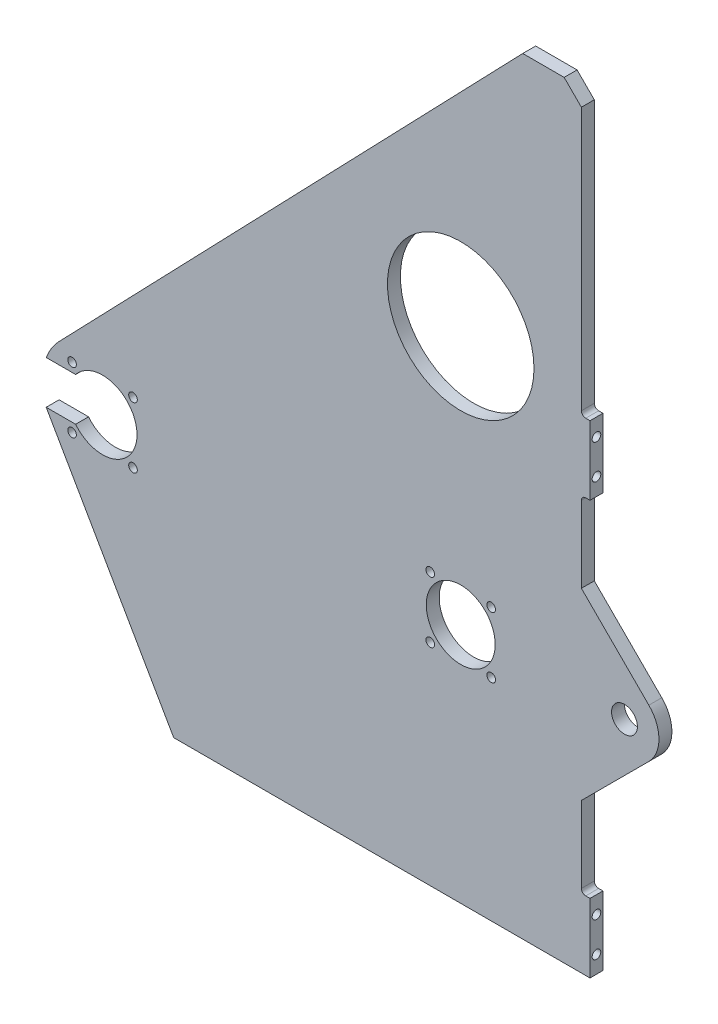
ISO-10303-21;
HEADER;
FILE_DESCRIPTION(('STEP AP214'),'2;1');
FILE_NAME('part.step','',(''),(''),'','','');
FILE_SCHEMA(('AUTOMOTIVE_DESIGN { 1 0 10303 214 1 1 1 1 }'));
ENDSEC;
DATA;
#1=APPLICATION_CONTEXT('core data for automotive mechanical design processes');
#2=APPLICATION_PROTOCOL_DEFINITION('international standard','automotive_design',2000,#1);
#3=PRODUCT_CONTEXT('',#1,'mechanical');
#4=PRODUCT('Part','Part','',(#3));
#5=PRODUCT_RELATED_PRODUCT_CATEGORY('part','',(#4));
#6=PRODUCT_DEFINITION_FORMATION('','',#4);
#7=PRODUCT_DEFINITION_CONTEXT('part definition',#1,'design');
#8=PRODUCT_DEFINITION('design','',#6,#7);
#9=PRODUCT_DEFINITION_SHAPE('','',#8);
#10=(LENGTH_UNIT() NAMED_UNIT(*) SI_UNIT(.MILLI.,.METRE.));
#11=(NAMED_UNIT(*) PLANE_ANGLE_UNIT() SI_UNIT($,.RADIAN.));
#12=(NAMED_UNIT(*) SI_UNIT($,.STERADIAN.) SOLID_ANGLE_UNIT());
#13=UNCERTAINTY_MEASURE_WITH_UNIT(LENGTH_MEASURE(1.E-05),#10,'distance_accuracy_value','');
#14=(GEOMETRIC_REPRESENTATION_CONTEXT(3) GLOBAL_UNCERTAINTY_ASSIGNED_CONTEXT((#13)) GLOBAL_UNIT_ASSIGNED_CONTEXT((#10,
#11,#12)) REPRESENTATION_CONTEXT('',''));
#15=CARTESIAN_POINT('',(0.,0.,0.));
#16=DIRECTION('',(0.,0.,1.));
#17=DIRECTION('',(1.,0.,0.));
#18=AXIS2_PLACEMENT_3D('',#15,#16,#17);
#19=CARTESIAN_POINT('',(145.,-195.,0.));
#20=DIRECTION('',(0.,0.,-1.));
#21=DIRECTION('',(-1.,0.,0.));
#22=AXIS2_PLACEMENT_3D('',#19,#20,#21);
#23=PLANE('',#22);
#24=CARTESIAN_POINT('',(-380.264660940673,38.3653390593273,0.));
#25=DIRECTION('',(0.,0.,-1.));
#26=DIRECTION('',(-1.,0.,0.));
#27=AXIS2_PLACEMENT_3D('',#24,#25,#26);
#28=CIRCLE('',#27,5.);
#29=CARTESIAN_POINT('',(-385.264660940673,38.3653390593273,0.));
#30=VERTEX_POINT('',#29);
#31=EDGE_CURVE('E251',#30,#30,#28,.T.);
#32=ORIENTED_EDGE('',*,*,#31,.F.);
#33=EDGE_LOOP('',(#32));
#34=FACE_BOUND('',#33,.T.);
#35=CARTESIAN_POINT('',(-450.975339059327,-32.3453390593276,0.));
#36=DIRECTION('',(0.,0.,-1.));
#37=DIRECTION('',(-1.,0.,0.));
#38=AXIS2_PLACEMENT_3D('',#35,#36,#37);
#39=CIRCLE('',#38,5.);
#40=CARTESIAN_POINT('',(-455.975339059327,-32.3453390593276,0.));
#41=VERTEX_POINT('',#40);
#42=EDGE_CURVE('E263',#41,#41,#39,.T.);
#43=ORIENTED_EDGE('',*,*,#42,.F.);
#44=EDGE_LOOP('',(#43));
#45=FACE_BOUND('',#44,.T.);
#46=CARTESIAN_POINT('',(-35.3553390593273,35.3553390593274,0.));
#47=DIRECTION('',(0.,0.,-1.));
#48=DIRECTION('',(-1.,0.,0.));
#49=AXIS2_PLACEMENT_3D('',#46,#47,#48);
#50=CIRCLE('',#49,5.);
#51=CARTESIAN_POINT('',(-40.3553390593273,35.3553390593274,0.));
#52=VERTEX_POINT('',#51);
#53=EDGE_CURVE('E275',#52,#52,#50,.T.);
#54=ORIENTED_EDGE('',*,*,#53,.F.);
#55=EDGE_LOOP('',(#54));
#56=FACE_BOUND('',#55,.T.);
#57=CARTESIAN_POINT('',(35.3553390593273,-35.3553390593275,0.));
#58=DIRECTION('',(0.,0.,-1.));
#59=DIRECTION('',(-1.,0.,0.));
#60=AXIS2_PLACEMENT_3D('',#57,#58,#59);
#61=CIRCLE('',#60,5.);
#62=CARTESIAN_POINT('',(30.3553390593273,-35.3553390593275,0.));
#63=VERTEX_POINT('',#62);
#64=EDGE_CURVE('E287',#63,#63,#61,.T.);
#65=ORIENTED_EDGE('',*,*,#64,.F.);
#66=EDGE_LOOP('',(#65));
#67=FACE_BOUND('',#66,.T.);
#68=CARTESIAN_POINT('',(190.,0.,0.));
#69=DIRECTION('',(0.,0.,1.));
#70=DIRECTION('',(1.,0.,0.));
#71=AXIS2_PLACEMENT_3D('',#68,#69,#70);
#72=CIRCLE('',#71,15.);
#73=CARTESIAN_POINT('',(205.,0.,0.));
#74=VERTEX_POINT('',#73);
#75=EDGE_CURVE('E299',#74,#74,#72,.T.);
#76=ORIENTED_EDGE('',*,*,#75,.T.);
#77=EDGE_LOOP('',(#76));
#78=FACE_BOUND('',#77,.T.);
#79=DIRECTION('',(-1.,0.,0.));
#80=VECTOR('',#79,1.);
#81=CARTESIAN_POINT('',(140.,610.,0.));
#82=LINE('',#81,#80);
#83=CARTESIAN_POINT('',(120.,610.,0.));
#84=VERTEX_POINT('',#83);
#85=CARTESIAN_POINT('',(71.9500000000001,610.,0.));
#86=VERTEX_POINT('',#85);
#87=EDGE_CURVE('E344',#84,#86,#82,.T.);
#88=ORIENTED_EDGE('',*,*,#87,.F.);
#89=DIRECTION('',(-0.707106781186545,0.70710678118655,0.));
#90=VECTOR('',#89,1.);
#91=CARTESIAN_POINT('',(535.,194.999999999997,0.));
#92=LINE('',#91,#90);
#93=CARTESIAN_POINT('',(140.,590.,0.));
#94=VERTEX_POINT('',#93);
#95=EDGE_CURVE('E49',#84,#94,#92,.F.);
#96=ORIENTED_EDGE('',*,*,#95,.T.);
#97=DIRECTION('',(0.,1.,0.));
#98=VECTOR('',#97,1.);
#99=CARTESIAN_POINT('',(140.,284.999999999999,0.));
#100=LINE('',#99,#98);
#101=CARTESIAN_POINT('',(140.,284.999999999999,0.));
#102=VERTEX_POINT('',#101);
#103=EDGE_CURVE('E342',#102,#94,#100,.T.);
#104=ORIENTED_EDGE('',*,*,#103,.F.);
#105=CARTESIAN_POINT('',(145.,284.999999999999,0.));
#106=DIRECTION('',(0.,0.,-1.));
#107=DIRECTION('',(-1.,0.,0.));
#108=AXIS2_PLACEMENT_3D('',#105,#106,#107);
#109=CIRCLE('',#108,5.);
#110=CARTESIAN_POINT('',(145.,279.999999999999,0.));
#111=VERTEX_POINT('',#110);
#112=EDGE_CURVE('E340',#111,#102,#109,.T.);
#113=ORIENTED_EDGE('',*,*,#112,.F.);
#114=DIRECTION('',(-1.,0.,0.));
#115=VECTOR('',#114,1.);
#116=CARTESIAN_POINT('',(145.,279.999999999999,0.));
#117=LINE('',#116,#115);
#118=CARTESIAN_POINT('',(150.,279.999999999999,0.));
#119=VERTEX_POINT('',#118);
#120=EDGE_CURVE('E338',#119,#111,#117,.T.);
#121=ORIENTED_EDGE('',*,*,#120,.F.);
#122=DIRECTION('',(0.,1.,0.));
#123=VECTOR('',#122,1.);
#124=CARTESIAN_POINT('',(150.,200.,0.));
#125=LINE('',#124,#123);
#126=CARTESIAN_POINT('',(150.,200.,0.));
#127=VERTEX_POINT('',#126);
#128=EDGE_CURVE('E336',#127,#119,#125,.T.);
#129=ORIENTED_EDGE('',*,*,#128,.F.);
#130=DIRECTION('',(1.,0.,0.));
#131=VECTOR('',#130,1.);
#132=CARTESIAN_POINT('',(144.999999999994,200.,0.));
#133=LINE('',#132,#131);
#134=CARTESIAN_POINT('',(144.999999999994,200.000000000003,0.));
#135=VERTEX_POINT('',#134);
#136=EDGE_CURVE('E334',#135,#127,#133,.T.);
#137=ORIENTED_EDGE('',*,*,#136,.F.);
#138=CARTESIAN_POINT('',(145.,195.,0.));
#139=DIRECTION('',(0.,0.,-1.));
#140=DIRECTION('',(1.,0.,0.));
#141=AXIS2_PLACEMENT_3D('',#138,#139,#140);
#142=CIRCLE('',#141,5.00000000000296);
#143=CARTESIAN_POINT('',(139.999999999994,195.000000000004,0.));
#144=VERTEX_POINT('',#143);
#145=EDGE_CURVE('E332',#144,#135,#142,.T.);
#146=ORIENTED_EDGE('',*,*,#145,.F.);
#147=DIRECTION('',(0.,1.,0.));
#148=VECTOR('',#147,1.);
#149=CARTESIAN_POINT('',(139.999999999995,106.568542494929,0.));
#150=LINE('',#149,#148);
#151=CARTESIAN_POINT('',(139.999999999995,106.568542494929,0.));
#152=VERTEX_POINT('',#151);
#153=EDGE_CURVE('E330',#152,#144,#150,.T.);
#154=ORIENTED_EDGE('',*,*,#153,.F.);
#155=DIRECTION('',(-0.707106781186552,0.707106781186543,0.));
#156=VECTOR('',#155,1.);
#157=CARTESIAN_POINT('',(139.999999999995,106.568542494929,0.));
#158=LINE('',#157,#156);
#159=CARTESIAN_POINT('',(218.284271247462,28.284271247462,0.));
#160=VERTEX_POINT('',#159);
#161=EDGE_CURVE('E328',#160,#152,#158,.T.);
#162=ORIENTED_EDGE('',*,*,#161,.F.);
#163=CARTESIAN_POINT('',(190.,0.,0.));
#164=DIRECTION('',(0.,0.,1.));
#165=DIRECTION('',(1.,0.,0.));
#166=AXIS2_PLACEMENT_3D('',#163,#164,#165);
#167=CIRCLE('',#166,40.0000000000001);
#168=CARTESIAN_POINT('',(218.284271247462,-28.2842712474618,0.));
#169=VERTEX_POINT('',#168);
#170=EDGE_CURVE('E326',#169,#160,#167,.T.);
#171=ORIENTED_EDGE('',*,*,#170,.F.);
#172=DIRECTION('',(0.707106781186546,0.707106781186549,0.));
#173=VECTOR('',#172,1.);
#174=CARTESIAN_POINT('',(218.284271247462,-28.2842712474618,0.));
#175=LINE('',#174,#173);
#176=CARTESIAN_POINT('',(140.,-106.568542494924,0.));
#177=VERTEX_POINT('',#176);
#178=EDGE_CURVE('E324',#177,#169,#175,.T.);
#179=ORIENTED_EDGE('',*,*,#178,.F.);
#180=DIRECTION('',(0.,1.,0.));
#181=VECTOR('',#180,1.);
#182=CARTESIAN_POINT('',(140.,-195.,0.));
#183=LINE('',#182,#181);
#184=CARTESIAN_POINT('',(140.,-195.,0.));
#185=VERTEX_POINT('',#184);
#186=EDGE_CURVE('E322',#185,#177,#183,.T.);
#187=ORIENTED_EDGE('',*,*,#186,.F.);
#188=CARTESIAN_POINT('',(145.,-195.,0.));
#189=DIRECTION('',(0.,0.,-1.));
#190=DIRECTION('',(-1.,0.,0.));
#191=AXIS2_PLACEMENT_3D('',#188,#189,#190);
#192=CIRCLE('',#191,5.);
#193=CARTESIAN_POINT('',(145.,-200.,0.));
#194=VERTEX_POINT('',#193);
#195=EDGE_CURVE('E320',#194,#185,#192,.T.);
#196=ORIENTED_EDGE('',*,*,#195,.F.);
#197=DIRECTION('',(-1.,0.,0.));
#198=VECTOR('',#197,1.);
#199=CARTESIAN_POINT('',(145.,-200.,0.));
#200=LINE('',#199,#198);
#201=CARTESIAN_POINT('',(150.,-200.,0.));
#202=VERTEX_POINT('',#201);
#203=EDGE_CURVE('E318',#202,#194,#200,.T.);
#204=ORIENTED_EDGE('',*,*,#203,.F.);
#205=DIRECTION('',(0.,1.,0.));
#206=VECTOR('',#205,1.);
#207=CARTESIAN_POINT('',(150.,-280.,0.));
#208=LINE('',#207,#206);
#209=CARTESIAN_POINT('',(150.,-280.,0.));
#210=VERTEX_POINT('',#209);
#211=EDGE_CURVE('E316',#210,#202,#208,.T.);
#212=ORIENTED_EDGE('',*,*,#211,.F.);
#213=DIRECTION('',(1.,0.,0.));
#214=VECTOR('',#213,1.);
#215=CARTESIAN_POINT('',(-333.06,-280.,0.));
#216=LINE('',#215,#214);
#217=CARTESIAN_POINT('',(-333.06,-280.,0.));
#218=VERTEX_POINT('',#217);
#219=EDGE_CURVE('E314',#218,#210,#216,.T.);
#220=ORIENTED_EDGE('',*,*,#219,.F.);
#221=DIRECTION('',(0.497432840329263,-0.867502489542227,0.));
#222=VECTOR('',#221,1.);
#223=CARTESIAN_POINT('',(-481.004989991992,-21.9900000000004,0.));
#224=LINE('',#223,#222);
#225=CARTESIAN_POINT('',(-481.004989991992,-21.9900000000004,0.));
#226=VERTEX_POINT('',#225);
#227=EDGE_CURVE('E311',#226,#218,#224,.T.);
#228=ORIENTED_EDGE('',*,*,#227,.F.);
#229=DIRECTION('',(-1.,0.,0.));
#230=VECTOR('',#229,1.);
#231=CARTESIAN_POINT('',(-481.004989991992,-21.9900000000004,0.));
#232=LINE('',#231,#230);
#233=CARTESIAN_POINT('',(-446.844989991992,-21.9900000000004,0.));
#234=VERTEX_POINT('',#233);
#235=EDGE_CURVE('E354',#234,#226,#232,.T.);
#236=ORIENTED_EDGE('',*,*,#235,.F.);
#237=CARTESIAN_POINT('',(-415.62,3.00999999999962,0.));
#238=DIRECTION('',(0.,0.,-1.));
#239=DIRECTION('',(1.,0.,0.));
#240=AXIS2_PLACEMENT_3D('',#237,#238,#239);
#241=CIRCLE('',#240,40.);
#242=CARTESIAN_POINT('',(-446.844989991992,28.0099999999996,0.));
#243=VERTEX_POINT('',#242);
#244=EDGE_CURVE('E352',#243,#234,#241,.T.);
#245=ORIENTED_EDGE('',*,*,#244,.F.);
#246=DIRECTION('',(1.,0.,0.));
#247=VECTOR('',#246,1.);
#248=CARTESIAN_POINT('',(-481.00348415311,28.0099999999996,0.));
#249=LINE('',#248,#247);
#250=CARTESIAN_POINT('',(-481.00348415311,28.0099999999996,0.));
#251=VERTEX_POINT('',#250);
#252=EDGE_CURVE('E350',#251,#243,#249,.T.);
#253=ORIENTED_EDGE('',*,*,#252,.F.);
#254=CARTESIAN_POINT('',(-415.62,3.00999999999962,0.));
#255=DIRECTION('',(0.,0.,1.));
#256=DIRECTION('',(1.,0.,0.));
#257=AXIS2_PLACEMENT_3D('',#254,#255,#256);
#258=CIRCLE('',#257,70.0000000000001);
#259=CARTESIAN_POINT('',(-466.031583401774,51.5761637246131,0.));
#260=VERTEX_POINT('',#259);
#261=EDGE_CURVE('E348',#260,#251,#258,.T.);
#262=ORIENTED_EDGE('',*,*,#261,.F.);
#263=DIRECTION('',(-0.693802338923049,-0.720165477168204,0.));
#264=VECTOR('',#263,1.);
#265=CARTESIAN_POINT('',(71.9500000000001,610.,0.));
#266=LINE('',#265,#264);
#267=EDGE_CURVE('E346',#86,#260,#266,.T.);
#268=ORIENTED_EDGE('',*,*,#267,.F.);
#269=EDGE_LOOP('',(#88,#96,#104,#113,#121,#129,#137,#146,#154,#162,#171,#179,#187,#196,#204,
#212,#220,#228,#236,#245,#253,#262,#268));
#270=FACE_BOUND('',#269,.T.);
#271=CARTESIAN_POINT('',(0.,0.,0.));
#272=DIRECTION('',(0.,0.,1.));
#273=DIRECTION('',(1.,0.,0.));
#274=AXIS2_PLACEMENT_3D('',#271,#272,#273);
#275=CIRCLE('',#274,40.);
#276=CARTESIAN_POINT('',(40.,0.,0.));
#277=VERTEX_POINT('',#276);
#278=EDGE_CURVE('E305',#277,#277,#275,.T.);
#279=ORIENTED_EDGE('',*,*,#278,.T.);
#280=EDGE_LOOP('',(#279));
#281=FACE_BOUND('',#280,.T.);
#282=CARTESIAN_POINT('',(0.,300.,0.));
#283=DIRECTION('',(0.,0.,1.));
#284=DIRECTION('',(1.,0.,0.));
#285=AXIS2_PLACEMENT_3D('',#282,#283,#284);
#286=CIRCLE('',#285,85.);
#287=CARTESIAN_POINT('',(85.,300.,0.));
#288=VERTEX_POINT('',#287);
#289=EDGE_CURVE('E293',#288,#288,#286,.T.);
#290=ORIENTED_EDGE('',*,*,#289,.T.);
#291=EDGE_LOOP('',(#290));
#292=FACE_BOUND('',#291,.T.);
#293=CARTESIAN_POINT('',(35.3553390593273,35.3553390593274,0.));
#294=DIRECTION('',(0.,0.,-1.));
#295=DIRECTION('',(-1.,0.,0.));
#296=AXIS2_PLACEMENT_3D('',#293,#294,#295);
#297=CIRCLE('',#296,5.);
#298=CARTESIAN_POINT('',(30.3553390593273,35.3553390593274,0.));
#299=VERTEX_POINT('',#298);
#300=EDGE_CURVE('E30',#299,#299,#297,.T.);
#301=ORIENTED_EDGE('',*,*,#300,.F.);
#302=EDGE_LOOP('',(#301));
#303=FACE_BOUND('',#302,.T.);
#304=CARTESIAN_POINT('',(-35.3553390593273,-35.3553390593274,0.));
#305=DIRECTION('',(0.,0.,-1.));
#306=DIRECTION('',(-1.,0.,0.));
#307=AXIS2_PLACEMENT_3D('',#304,#305,#306);
#308=CIRCLE('',#307,5.);
#309=CARTESIAN_POINT('',(-40.3553390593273,-35.3553390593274,0.));
#310=VERTEX_POINT('',#309);
#311=EDGE_CURVE('E281',#310,#310,#308,.T.);
#312=ORIENTED_EDGE('',*,*,#311,.F.);
#313=EDGE_LOOP('',(#312));
#314=FACE_BOUND('',#313,.T.);
#315=CARTESIAN_POINT('',(-450.975339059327,38.3653390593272,0.));
#316=DIRECTION('',(0.,0.,-1.));
#317=DIRECTION('',(-1.,0.,0.));
#318=AXIS2_PLACEMENT_3D('',#315,#316,#317);
#319=CIRCLE('',#318,5.);
#320=CARTESIAN_POINT('',(-455.975339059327,38.3653390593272,0.));
#321=VERTEX_POINT('',#320);
#322=EDGE_CURVE('E269',#321,#321,#319,.T.);
#323=ORIENTED_EDGE('',*,*,#322,.F.);
#324=EDGE_LOOP('',(#323));
#325=FACE_BOUND('',#324,.T.);
#326=CARTESIAN_POINT('',(-380.264660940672,-32.3453390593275,0.));
#327=DIRECTION('',(0.,0.,-1.));
#328=DIRECTION('',(-1.,0.,0.));
#329=AXIS2_PLACEMENT_3D('',#326,#327,#328);
#330=CIRCLE('',#329,5.);
#331=CARTESIAN_POINT('',(-385.264660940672,-32.3453390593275,0.));
#332=VERTEX_POINT('',#331);
#333=EDGE_CURVE('E257',#332,#332,#330,.T.);
#334=ORIENTED_EDGE('',*,*,#333,.F.);
#335=EDGE_LOOP('',(#334));
#336=FACE_BOUND('',#335,.T.);
#337=ADVANCED_FACE('F26',(#34,#45,#56,#67,#78,#270,#281,#292,#303,#314,#325,#336),#23,.T.);
#338=CARTESIAN_POINT('',(145.,-195.,15.));
#339=DIRECTION('',(0.,0.,-1.));
#340=DIRECTION('',(-1.,0.,0.));
#341=AXIS2_PLACEMENT_3D('',#338,#339,#340);
#342=PLANE('',#341);
#343=CARTESIAN_POINT('',(-380.264660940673,38.3653390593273,15.));
#344=DIRECTION('',(0.,0.,1.));
#345=DIRECTION('',(1.,0.,0.));
#346=AXIS2_PLACEMENT_3D('',#343,#344,#345);
#347=CIRCLE('',#346,5.);
#348=CARTESIAN_POINT('',(-375.264660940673,38.3653390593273,15.));
#349=VERTEX_POINT('',#348);
#350=EDGE_CURVE('E248',#349,#349,#347,.T.);
#351=ORIENTED_EDGE('',*,*,#350,.F.);
#352=EDGE_LOOP('',(#351));
#353=FACE_BOUND('',#352,.T.);
#354=CARTESIAN_POINT('',(-380.264660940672,-32.3453390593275,15.));
#355=DIRECTION('',(0.,0.,1.));
#356=DIRECTION('',(1.,0.,0.));
#357=AXIS2_PLACEMENT_3D('',#354,#355,#356);
#358=CIRCLE('',#357,5.);
#359=CARTESIAN_POINT('',(-375.264660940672,-32.3453390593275,15.));
#360=VERTEX_POINT('',#359);
#361=EDGE_CURVE('E254',#360,#360,#358,.T.);
#362=ORIENTED_EDGE('',*,*,#361,.F.);
#363=EDGE_LOOP('',(#362));
#364=FACE_BOUND('',#363,.T.);
#365=CARTESIAN_POINT('',(-450.975339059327,-32.3453390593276,15.));
#366=DIRECTION('',(0.,0.,1.));
#367=DIRECTION('',(1.,0.,0.));
#368=AXIS2_PLACEMENT_3D('',#365,#366,#367);
#369=CIRCLE('',#368,5.);
#370=CARTESIAN_POINT('',(-445.975339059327,-32.3453390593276,15.));
#371=VERTEX_POINT('',#370);
#372=EDGE_CURVE('E260',#371,#371,#369,.T.);
#373=ORIENTED_EDGE('',*,*,#372,.F.);
#374=EDGE_LOOP('',(#373));
#375=FACE_BOUND('',#374,.T.);
#376=CARTESIAN_POINT('',(-450.975339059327,38.3653390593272,15.));
#377=DIRECTION('',(0.,0.,1.));
#378=DIRECTION('',(1.,0.,0.));
#379=AXIS2_PLACEMENT_3D('',#376,#377,#378);
#380=CIRCLE('',#379,5.);
#381=CARTESIAN_POINT('',(-445.975339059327,38.3653390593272,15.));
#382=VERTEX_POINT('',#381);
#383=EDGE_CURVE('E266',#382,#382,#380,.T.);
#384=ORIENTED_EDGE('',*,*,#383,.F.);
#385=EDGE_LOOP('',(#384));
#386=FACE_BOUND('',#385,.T.);
#387=CARTESIAN_POINT('',(-35.3553390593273,35.3553390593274,15.));
#388=DIRECTION('',(0.,0.,1.));
#389=DIRECTION('',(1.,0.,0.));
#390=AXIS2_PLACEMENT_3D('',#387,#388,#389);
#391=CIRCLE('',#390,5.);
#392=CARTESIAN_POINT('',(-30.3553390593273,35.3553390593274,15.));
#393=VERTEX_POINT('',#392);
#394=EDGE_CURVE('E272',#393,#393,#391,.T.);
#395=ORIENTED_EDGE('',*,*,#394,.F.);
#396=EDGE_LOOP('',(#395));
#397=FACE_BOUND('',#396,.T.);
#398=CARTESIAN_POINT('',(-35.3553390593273,-35.3553390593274,15.));
#399=DIRECTION('',(0.,0.,1.));
#400=DIRECTION('',(1.,0.,0.));
#401=AXIS2_PLACEMENT_3D('',#398,#399,#400);
#402=CIRCLE('',#401,5.);
#403=CARTESIAN_POINT('',(-30.3553390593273,-35.3553390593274,15.));
#404=VERTEX_POINT('',#403);
#405=EDGE_CURVE('E278',#404,#404,#402,.T.);
#406=ORIENTED_EDGE('',*,*,#405,.F.);
#407=EDGE_LOOP('',(#406));
#408=FACE_BOUND('',#407,.T.);
#409=CARTESIAN_POINT('',(35.3553390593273,-35.3553390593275,15.));
#410=DIRECTION('',(0.,0.,1.));
#411=DIRECTION('',(1.,0.,0.));
#412=AXIS2_PLACEMENT_3D('',#409,#410,#411);
#413=CIRCLE('',#412,5.);
#414=CARTESIAN_POINT('',(40.3553390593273,-35.3553390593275,15.));
#415=VERTEX_POINT('',#414);
#416=EDGE_CURVE('E284',#415,#415,#413,.T.);
#417=ORIENTED_EDGE('',*,*,#416,.F.);
#418=EDGE_LOOP('',(#417));
#419=FACE_BOUND('',#418,.T.);
#420=CARTESIAN_POINT('',(35.3553390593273,35.3553390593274,15.));
#421=DIRECTION('',(0.,0.,1.));
#422=DIRECTION('',(1.,0.,0.));
#423=AXIS2_PLACEMENT_3D('',#420,#421,#422);
#424=CIRCLE('',#423,5.);
#425=CARTESIAN_POINT('',(40.3553390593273,35.3553390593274,15.));
#426=VERTEX_POINT('',#425);
#427=EDGE_CURVE('E290',#426,#426,#424,.T.);
#428=ORIENTED_EDGE('',*,*,#427,.F.);
#429=EDGE_LOOP('',(#428));
#430=FACE_BOUND('',#429,.T.);
#431=CARTESIAN_POINT('',(190.,0.,15.));
#432=DIRECTION('',(0.,0.,1.));
#433=DIRECTION('',(1.,0.,0.));
#434=AXIS2_PLACEMENT_3D('',#431,#432,#433);
#435=CIRCLE('',#434,15.);
#436=CARTESIAN_POINT('',(205.,0.,15.));
#437=VERTEX_POINT('',#436);
#438=EDGE_CURVE('E302',#437,#437,#435,.T.);
#439=ORIENTED_EDGE('',*,*,#438,.F.);
#440=EDGE_LOOP('',(#439));
#441=FACE_BOUND('',#440,.T.);
#442=DIRECTION('',(0.,1.,0.));
#443=VECTOR('',#442,1.);
#444=CARTESIAN_POINT('',(140.,284.999999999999,15.));
#445=LINE('',#444,#443);
#446=CARTESIAN_POINT('',(140.,284.999999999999,15.));
#447=VERTEX_POINT('',#446);
#448=CARTESIAN_POINT('',(140.,589.999999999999,15.));
#449=VERTEX_POINT('',#448);
#450=EDGE_CURVE('E387',#447,#449,#445,.T.);
#451=ORIENTED_EDGE('',*,*,#450,.T.);
#452=DIRECTION('',(0.707106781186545,-0.70710678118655,0.));
#453=VECTOR('',#452,1.);
#454=CARTESIAN_POINT('',(120.,610.,15.));
#455=LINE('',#454,#453);
#456=CARTESIAN_POINT('',(120.,610.,15.));
#457=VERTEX_POINT('',#456);
#458=EDGE_CURVE('E11',#449,#457,#455,.F.);
#459=ORIENTED_EDGE('',*,*,#458,.T.);
#460=DIRECTION('',(-1.,0.,0.));
#461=VECTOR('',#460,1.);
#462=CARTESIAN_POINT('',(140.,610.,15.));
#463=LINE('',#462,#461);
#464=CARTESIAN_POINT('',(71.9500000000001,610.,15.));
#465=VERTEX_POINT('',#464);
#466=EDGE_CURVE('E389',#457,#465,#463,.T.);
#467=ORIENTED_EDGE('',*,*,#466,.T.);
#468=DIRECTION('',(-0.693802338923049,-0.720165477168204,0.));
#469=VECTOR('',#468,1.);
#470=CARTESIAN_POINT('',(71.9500000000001,610.,15.));
#471=LINE('',#470,#469);
#472=CARTESIAN_POINT('',(-466.031583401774,51.5761637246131,15.));
#473=VERTEX_POINT('',#472);
#474=EDGE_CURVE('E391',#465,#473,#471,.T.);
#475=ORIENTED_EDGE('',*,*,#474,.T.);
#476=CARTESIAN_POINT('',(-415.62,3.00999999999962,15.));
#477=DIRECTION('',(0.,0.,1.));
#478=DIRECTION('',(1.,0.,0.));
#479=AXIS2_PLACEMENT_3D('',#476,#477,#478);
#480=CIRCLE('',#479,70.0000000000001);
#481=CARTESIAN_POINT('',(-481.00348415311,28.0099999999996,15.));
#482=VERTEX_POINT('',#481);
#483=EDGE_CURVE('E393',#473,#482,#480,.T.);
#484=ORIENTED_EDGE('',*,*,#483,.T.);
#485=DIRECTION('',(1.,0.,0.));
#486=VECTOR('',#485,1.);
#487=CARTESIAN_POINT('',(-481.00348415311,28.0099999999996,15.));
#488=LINE('',#487,#486);
#489=CARTESIAN_POINT('',(-446.844989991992,28.0099999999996,15.));
#490=VERTEX_POINT('',#489);
#491=EDGE_CURVE('E395',#482,#490,#488,.T.);
#492=ORIENTED_EDGE('',*,*,#491,.T.);
#493=CARTESIAN_POINT('',(-415.62,3.00999999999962,15.));
#494=DIRECTION('',(0.,0.,-1.));
#495=DIRECTION('',(1.,0.,0.));
#496=AXIS2_PLACEMENT_3D('',#493,#494,#495);
#497=CIRCLE('',#496,40.);
#498=CARTESIAN_POINT('',(-446.844989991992,-21.9900000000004,15.));
#499=VERTEX_POINT('',#498);
#500=EDGE_CURVE('E397',#490,#499,#497,.T.);
#501=ORIENTED_EDGE('',*,*,#500,.T.);
#502=DIRECTION('',(-1.,0.,0.));
#503=VECTOR('',#502,1.);
#504=CARTESIAN_POINT('',(-481.004989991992,-21.9900000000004,15.));
#505=LINE('',#504,#503);
#506=CARTESIAN_POINT('',(-481.004989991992,-21.9900000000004,15.));
#507=VERTEX_POINT('',#506);
#508=EDGE_CURVE('E399',#499,#507,#505,.T.);
#509=ORIENTED_EDGE('',*,*,#508,.T.);
#510=DIRECTION('',(0.497432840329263,-0.867502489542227,0.));
#511=VECTOR('',#510,1.);
#512=CARTESIAN_POINT('',(-481.004989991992,-21.9900000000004,15.));
#513=LINE('',#512,#511);
#514=CARTESIAN_POINT('',(-333.06,-280.,15.));
#515=VERTEX_POINT('',#514);
#516=EDGE_CURVE('E356',#507,#515,#513,.T.);
#517=ORIENTED_EDGE('',*,*,#516,.T.);
#518=DIRECTION('',(1.,0.,0.));
#519=VECTOR('',#518,1.);
#520=CARTESIAN_POINT('',(-333.06,-280.,15.));
#521=LINE('',#520,#519);
#522=CARTESIAN_POINT('',(150.,-280.,15.));
#523=VERTEX_POINT('',#522);
#524=EDGE_CURVE('E359',#515,#523,#521,.T.);
#525=ORIENTED_EDGE('',*,*,#524,.T.);
#526=DIRECTION('',(0.,1.,0.));
#527=VECTOR('',#526,1.);
#528=CARTESIAN_POINT('',(150.,-280.,15.));
#529=LINE('',#528,#527);
#530=CARTESIAN_POINT('',(150.,-200.,15.));
#531=VERTEX_POINT('',#530);
#532=EDGE_CURVE('E361',#523,#531,#529,.T.);
#533=ORIENTED_EDGE('',*,*,#532,.T.);
#534=DIRECTION('',(-1.,0.,0.));
#535=VECTOR('',#534,1.);
#536=CARTESIAN_POINT('',(145.,-200.,15.));
#537=LINE('',#536,#535);
#538=CARTESIAN_POINT('',(145.,-200.,15.));
#539=VERTEX_POINT('',#538);
#540=EDGE_CURVE('E363',#531,#539,#537,.T.);
#541=ORIENTED_EDGE('',*,*,#540,.T.);
#542=CARTESIAN_POINT('',(145.,-195.,15.));
#543=DIRECTION('',(0.,0.,-1.));
#544=DIRECTION('',(-1.,0.,0.));
#545=AXIS2_PLACEMENT_3D('',#542,#543,#544);
#546=CIRCLE('',#545,5.);
#547=CARTESIAN_POINT('',(140.,-195.,15.));
#548=VERTEX_POINT('',#547);
#549=EDGE_CURVE('E365',#539,#548,#546,.T.);
#550=ORIENTED_EDGE('',*,*,#549,.T.);
#551=DIRECTION('',(0.,1.,0.));
#552=VECTOR('',#551,1.);
#553=CARTESIAN_POINT('',(140.,-195.,15.));
#554=LINE('',#553,#552);
#555=CARTESIAN_POINT('',(140.,-106.568542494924,15.));
#556=VERTEX_POINT('',#555);
#557=EDGE_CURVE('E367',#548,#556,#554,.T.);
#558=ORIENTED_EDGE('',*,*,#557,.T.);
#559=DIRECTION('',(0.707106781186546,0.707106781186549,0.));
#560=VECTOR('',#559,1.);
#561=CARTESIAN_POINT('',(218.284271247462,-28.2842712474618,15.));
#562=LINE('',#561,#560);
#563=CARTESIAN_POINT('',(218.284271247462,-28.2842712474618,15.));
#564=VERTEX_POINT('',#563);
#565=EDGE_CURVE('E369',#556,#564,#562,.T.);
#566=ORIENTED_EDGE('',*,*,#565,.T.);
#567=CARTESIAN_POINT('',(190.,0.,15.));
#568=DIRECTION('',(0.,0.,1.));
#569=DIRECTION('',(1.,0.,0.));
#570=AXIS2_PLACEMENT_3D('',#567,#568,#569);
#571=CIRCLE('',#570,40.0000000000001);
#572=CARTESIAN_POINT('',(218.284271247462,28.284271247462,15.));
#573=VERTEX_POINT('',#572);
#574=EDGE_CURVE('E371',#564,#573,#571,.T.);
#575=ORIENTED_EDGE('',*,*,#574,.T.);
#576=DIRECTION('',(-0.707106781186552,0.707106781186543,0.));
#577=VECTOR('',#576,1.);
#578=CARTESIAN_POINT('',(139.999999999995,106.568542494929,15.));
#579=LINE('',#578,#577);
#580=CARTESIAN_POINT('',(139.999999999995,106.568542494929,15.));
#581=VERTEX_POINT('',#580);
#582=EDGE_CURVE('E373',#573,#581,#579,.T.);
#583=ORIENTED_EDGE('',*,*,#582,.T.);
#584=DIRECTION('',(0.,1.,0.));
#585=VECTOR('',#584,1.);
#586=CARTESIAN_POINT('',(139.999999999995,106.568542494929,15.));
#587=LINE('',#586,#585);
#588=CARTESIAN_POINT('',(139.999999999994,195.000000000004,15.));
#589=VERTEX_POINT('',#588);
#590=EDGE_CURVE('E375',#581,#589,#587,.T.);
#591=ORIENTED_EDGE('',*,*,#590,.T.);
#592=CARTESIAN_POINT('',(145.,195.,15.));
#593=DIRECTION('',(0.,0.,-1.));
#594=DIRECTION('',(1.,0.,0.));
#595=AXIS2_PLACEMENT_3D('',#592,#593,#594);
#596=CIRCLE('',#595,5.00000000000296);
#597=CARTESIAN_POINT('',(144.999999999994,200.000000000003,15.));
#598=VERTEX_POINT('',#597);
#599=EDGE_CURVE('E377',#589,#598,#596,.T.);
#600=ORIENTED_EDGE('',*,*,#599,.T.);
#601=DIRECTION('',(1.,0.,0.));
#602=VECTOR('',#601,1.);
#603=CARTESIAN_POINT('',(144.999999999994,200.,15.));
#604=LINE('',#603,#602);
#605=CARTESIAN_POINT('',(150.,200.,15.));
#606=VERTEX_POINT('',#605);
#607=EDGE_CURVE('E379',#598,#606,#604,.T.);
#608=ORIENTED_EDGE('',*,*,#607,.T.);
#609=DIRECTION('',(0.,1.,0.));
#610=VECTOR('',#609,1.);
#611=CARTESIAN_POINT('',(150.,200.,15.));
#612=LINE('',#611,#610);
#613=CARTESIAN_POINT('',(150.,279.999999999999,15.));
#614=VERTEX_POINT('',#613);
#615=EDGE_CURVE('E381',#606,#614,#612,.T.);
#616=ORIENTED_EDGE('',*,*,#615,.T.);
#617=DIRECTION('',(-1.,0.,0.));
#618=VECTOR('',#617,1.);
#619=CARTESIAN_POINT('',(145.,279.999999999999,15.));
#620=LINE('',#619,#618);
#621=CARTESIAN_POINT('',(145.,279.999999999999,15.));
#622=VERTEX_POINT('',#621);
#623=EDGE_CURVE('E383',#614,#622,#620,.T.);
#624=ORIENTED_EDGE('',*,*,#623,.T.);
#625=CARTESIAN_POINT('',(145.,284.999999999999,15.));
#626=DIRECTION('',(0.,0.,-1.));
#627=DIRECTION('',(-1.,0.,0.));
#628=AXIS2_PLACEMENT_3D('',#625,#626,#627);
#629=CIRCLE('',#628,5.);
#630=EDGE_CURVE('E385',#622,#447,#629,.T.);
#631=ORIENTED_EDGE('',*,*,#630,.T.);
#632=EDGE_LOOP('',(#451,#459,#467,#475,#484,#492,#501,#509,#517,#525,#533,#541,#550,#558,#566,
#575,#583,#591,#600,#608,#616,#624,#631));
#633=FACE_BOUND('',#632,.T.);
#634=CARTESIAN_POINT('',(0.,0.,15.));
#635=DIRECTION('',(0.,0.,1.));
#636=DIRECTION('',(1.,0.,0.));
#637=AXIS2_PLACEMENT_3D('',#634,#635,#636);
#638=CIRCLE('',#637,40.);
#639=CARTESIAN_POINT('',(40.,0.,15.));
#640=VERTEX_POINT('',#639);
#641=EDGE_CURVE('E308',#640,#640,#638,.T.);
#642=ORIENTED_EDGE('',*,*,#641,.F.);
#643=EDGE_LOOP('',(#642));
#644=FACE_BOUND('',#643,.T.);
#645=CARTESIAN_POINT('',(0.,300.,15.));
#646=DIRECTION('',(0.,0.,1.));
#647=DIRECTION('',(1.,0.,0.));
#648=AXIS2_PLACEMENT_3D('',#645,#646,#647);
#649=CIRCLE('',#648,85.);
#650=CARTESIAN_POINT('',(85.,300.,15.));
#651=VERTEX_POINT('',#650);
#652=EDGE_CURVE('E296',#651,#651,#649,.T.);
#653=ORIENTED_EDGE('',*,*,#652,.F.);
#654=EDGE_LOOP('',(#653));
#655=FACE_BOUND('',#654,.T.);
#656=ADVANCED_FACE('F489',(#353,#364,#375,#386,#397,#408,#419,#430,#441,#633,#644,#655),#342,.F.);
#657=CARTESIAN_POINT('',(-481.004989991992,-21.9900000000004,15.));
#658=DIRECTION('',(0.867502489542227,0.497432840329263,0.));
#659=DIRECTION('',(-0.497432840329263,0.867502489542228,0.));
#660=AXIS2_PLACEMENT_3D('',#657,#658,#659);
#661=PLANE('',#660);
#662=ORIENTED_EDGE('',*,*,#227,.T.);
#663=DIRECTION('',(0.,0.,-1.));
#664=VECTOR('',#663,1.);
#665=CARTESIAN_POINT('',(-333.06,-280.,15.));
#666=LINE('',#665,#664);
#667=EDGE_CURVE('E461',#515,#218,#666,.T.);
#668=ORIENTED_EDGE('',*,*,#667,.F.);
#669=ORIENTED_EDGE('',*,*,#516,.F.);
#670=DIRECTION('',(0.,0.,-1.));
#671=VECTOR('',#670,1.);
#672=CARTESIAN_POINT('',(-481.004989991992,-21.9900000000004,15.));
#673=LINE('',#672,#671);
#674=EDGE_CURVE('E401',#507,#226,#673,.T.);
#675=ORIENTED_EDGE('',*,*,#674,.T.);
#676=EDGE_LOOP('',(#662,#668,#669,#675));
#677=FACE_BOUND('',#676,.T.);
#678=ADVANCED_FACE('F28',(#677),#661,.F.);
#679=CARTESIAN_POINT('',(-333.06,-280.,15.));
#680=DIRECTION('',(0.,1.,0.));
#681=DIRECTION('',(-1.,0.,0.));
#682=AXIS2_PLACEMENT_3D('',#679,#680,#681);
#683=PLANE('',#682);
#684=ORIENTED_EDGE('',*,*,#219,.T.);
#685=DIRECTION('',(0.,0.,-1.));
#686=VECTOR('',#685,1.);
#687=CARTESIAN_POINT('',(150.,-280.,15.));
#688=LINE('',#687,#686);
#689=EDGE_CURVE('E458',#523,#210,#688,.T.);
#690=ORIENTED_EDGE('',*,*,#689,.F.);
#691=ORIENTED_EDGE('',*,*,#524,.F.);
#692=ORIENTED_EDGE('',*,*,#667,.T.);
#693=EDGE_LOOP('',(#684,#690,#691,#692));
#694=FACE_BOUND('',#693,.T.);
#695=ADVANCED_FACE('F593',(#694),#683,.F.);
#696=CARTESIAN_POINT('',(150.,-280.,15.));
#697=DIRECTION('',(-1.,0.,0.));
#698=DIRECTION('',(0.,0.,1.));
#699=AXIS2_PLACEMENT_3D('',#696,#697,#698);
#700=PLANE('',#699);
#701=CARTESIAN_POINT('',(150.,-260.,7.5));
#702=DIRECTION('',(1.,0.,0.));
#703=DIRECTION('',(0.,0.,-1.));
#704=AXIS2_PLACEMENT_3D('',#701,#702,#703);
#705=CIRCLE('',#704,5.);
#706=CARTESIAN_POINT('',(150.,-260.,2.5));
#707=VERTEX_POINT('',#706);
#708=EDGE_CURVE('E209',#707,#707,#705,.T.);
#709=ORIENTED_EDGE('',*,*,#708,.F.);
#710=EDGE_LOOP('',(#709));
#711=FACE_BOUND('',#710,.T.);
#712=CARTESIAN_POINT('',(150.,-220.,7.5));
#713=DIRECTION('',(1.,0.,0.));
#714=DIRECTION('',(0.,0.,-1.));
#715=AXIS2_PLACEMENT_3D('',#712,#713,#714);
#716=CIRCLE('',#715,5.);
#717=CARTESIAN_POINT('',(150.,-220.,2.5));
#718=VERTEX_POINT('',#717);
#719=EDGE_CURVE('E221',#718,#718,#716,.T.);
#720=ORIENTED_EDGE('',*,*,#719,.F.);
#721=EDGE_LOOP('',(#720));
#722=FACE_BOUND('',#721,.T.);
#723=ORIENTED_EDGE('',*,*,#211,.T.);
#724=DIRECTION('',(0.,0.,-1.));
#725=VECTOR('',#724,1.);
#726=CARTESIAN_POINT('',(150.,-200.,15.));
#727=LINE('',#726,#725);
#728=EDGE_CURVE('E455',#531,#202,#727,.T.);
#729=ORIENTED_EDGE('',*,*,#728,.F.);
#730=ORIENTED_EDGE('',*,*,#532,.F.);
#731=ORIENTED_EDGE('',*,*,#689,.T.);
#732=EDGE_LOOP('',(#723,#729,#730,#731));
#733=FACE_BOUND('',#732,.T.);
#734=ADVANCED_FACE('F590',(#711,#722,#733),#700,.F.);
#735=CARTESIAN_POINT('',(145.,-200.,15.));
#736=DIRECTION('',(0.,-1.,0.));
#737=DIRECTION('',(0.,0.,-1.));
#738=AXIS2_PLACEMENT_3D('',#735,#736,#737);
#739=PLANE('',#738);
#740=ORIENTED_EDGE('',*,*,#203,.T.);
#741=DIRECTION('',(0.,0.,-1.));
#742=VECTOR('',#741,1.);
#743=CARTESIAN_POINT('',(145.,-200.,15.));
#744=LINE('',#743,#742);
#745=EDGE_CURVE('E452',#539,#194,#744,.T.);
#746=ORIENTED_EDGE('',*,*,#745,.F.);
#747=ORIENTED_EDGE('',*,*,#540,.F.);
#748=ORIENTED_EDGE('',*,*,#728,.T.);
#749=EDGE_LOOP('',(#740,#746,#747,#748));
#750=FACE_BOUND('',#749,.T.);
#751=ADVANCED_FACE('F586',(#750),#739,.F.);
#752=CARTESIAN_POINT('',(145.,-195.,15.));
#753=DIRECTION('',(0.,0.,-1.));
#754=DIRECTION('',(-1.,0.,0.));
#755=AXIS2_PLACEMENT_3D('',#752,#753,#754);
#756=CYLINDRICAL_SURFACE('',#755,5.);
#757=ORIENTED_EDGE('',*,*,#195,.T.);
#758=DIRECTION('',(0.,0.,-1.));
#759=VECTOR('',#758,1.);
#760=CARTESIAN_POINT('',(140.,-195.,15.));
#761=LINE('',#760,#759);
#762=EDGE_CURVE('E449',#548,#185,#761,.T.);
#763=ORIENTED_EDGE('',*,*,#762,.F.);
#764=ORIENTED_EDGE('',*,*,#549,.F.);
#765=ORIENTED_EDGE('',*,*,#745,.T.);
#766=EDGE_LOOP('',(#757,#763,#764,#765));
#767=FACE_BOUND('',#766,.T.);
#768=ADVANCED_FACE('F582',(#767),#756,.F.);
#769=CARTESIAN_POINT('',(140.,-195.,15.));
#770=DIRECTION('',(-1.,0.,0.));
#771=DIRECTION('',(0.,-1.,0.));
#772=AXIS2_PLACEMENT_3D('',#769,#770,#771);
#773=PLANE('',#772);
#774=ORIENTED_EDGE('',*,*,#186,.T.);
#775=DIRECTION('',(0.,0.,-1.));
#776=VECTOR('',#775,1.);
#777=CARTESIAN_POINT('',(140.,-106.568542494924,15.));
#778=LINE('',#777,#776);
#779=EDGE_CURVE('E446',#556,#177,#778,.T.);
#780=ORIENTED_EDGE('',*,*,#779,.F.);
#781=ORIENTED_EDGE('',*,*,#557,.F.);
#782=ORIENTED_EDGE('',*,*,#762,.T.);
#783=EDGE_LOOP('',(#774,#780,#781,#782));
#784=FACE_BOUND('',#783,.T.);
#785=ADVANCED_FACE('F578',(#784),#773,.F.);
#786=CARTESIAN_POINT('',(218.284271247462,-28.2842712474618,15.));
#787=DIRECTION('',(-0.707106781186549,0.707106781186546,0.));
#788=DIRECTION('',(-0.707106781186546,-0.707106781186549,0.));
#789=AXIS2_PLACEMENT_3D('',#786,#787,#788);
#790=PLANE('',#789);
#791=ORIENTED_EDGE('',*,*,#178,.T.);
#792=DIRECTION('',(0.,0.,-1.));
#793=VECTOR('',#792,1.);
#794=CARTESIAN_POINT('',(218.284271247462,-28.2842712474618,15.));
#795=LINE('',#794,#793);
#796=EDGE_CURVE('E443',#564,#169,#795,.T.);
#797=ORIENTED_EDGE('',*,*,#796,.F.);
#798=ORIENTED_EDGE('',*,*,#565,.F.);
#799=ORIENTED_EDGE('',*,*,#779,.T.);
#800=EDGE_LOOP('',(#791,#797,#798,#799));
#801=FACE_BOUND('',#800,.T.);
#802=ADVANCED_FACE('F574',(#801),#790,.F.);
#803=CARTESIAN_POINT('',(190.,0.,15.));
#804=DIRECTION('',(0.,0.,-1.));
#805=DIRECTION('',(-1.,0.,0.));
#806=AXIS2_PLACEMENT_3D('',#803,#804,#805);
#807=CYLINDRICAL_SURFACE('',#806,40.0000000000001);
#808=ORIENTED_EDGE('',*,*,#170,.T.);
#809=DIRECTION('',(0.,0.,-1.));
#810=VECTOR('',#809,1.);
#811=CARTESIAN_POINT('',(218.284271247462,28.284271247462,15.));
#812=LINE('',#811,#810);
#813=EDGE_CURVE('E440',#573,#160,#812,.T.);
#814=ORIENTED_EDGE('',*,*,#813,.F.);
#815=ORIENTED_EDGE('',*,*,#574,.F.);
#816=ORIENTED_EDGE('',*,*,#796,.T.);
#817=EDGE_LOOP('',(#808,#814,#815,#816));
#818=FACE_BOUND('',#817,.T.);
#819=ADVANCED_FACE('F570',(#818),#807,.T.);
#820=CARTESIAN_POINT('',(139.999999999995,106.568542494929,15.));
#821=DIRECTION('',(-0.707106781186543,-0.707106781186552,0.));
#822=DIRECTION('',(0.707106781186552,-0.707106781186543,0.));
#823=AXIS2_PLACEMENT_3D('',#820,#821,#822);
#824=PLANE('',#823);
#825=ORIENTED_EDGE('',*,*,#161,.T.);
#826=DIRECTION('',(0.,0.,-1.));
#827=VECTOR('',#826,1.);
#828=CARTESIAN_POINT('',(139.999999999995,106.568542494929,15.));
#829=LINE('',#828,#827);
#830=EDGE_CURVE('E437',#581,#152,#829,.T.);
#831=ORIENTED_EDGE('',*,*,#830,.F.);
#832=ORIENTED_EDGE('',*,*,#582,.F.);
#833=ORIENTED_EDGE('',*,*,#813,.T.);
#834=EDGE_LOOP('',(#825,#831,#832,#833));
#835=FACE_BOUND('',#834,.T.);
#836=ADVANCED_FACE('F566',(#835),#824,.F.);
#837=CARTESIAN_POINT('',(139.999999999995,106.568542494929,15.));
#838=DIRECTION('',(-1.,0.,0.));
#839=DIRECTION('',(0.,-1.,0.));
#840=AXIS2_PLACEMENT_3D('',#837,#838,#839);
#841=PLANE('',#840);
#842=ORIENTED_EDGE('',*,*,#153,.T.);
#843=DIRECTION('',(0.,0.,-1.));
#844=VECTOR('',#843,1.);
#845=CARTESIAN_POINT('',(139.999999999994,195.000000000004,15.));
#846=LINE('',#845,#844);
#847=EDGE_CURVE('E434',#589,#144,#846,.T.);
#848=ORIENTED_EDGE('',*,*,#847,.F.);
#849=ORIENTED_EDGE('',*,*,#590,.F.);
#850=ORIENTED_EDGE('',*,*,#830,.T.);
#851=EDGE_LOOP('',(#842,#848,#849,#850));
#852=FACE_BOUND('',#851,.T.);
#853=ADVANCED_FACE('F562',(#852),#841,.F.);
#854=CARTESIAN_POINT('',(145.,195.,15.));
#855=DIRECTION('',(0.,0.,-1.));
#856=DIRECTION('',(-1.,0.,0.));
#857=AXIS2_PLACEMENT_3D('',#854,#855,#856);
#858=CYLINDRICAL_SURFACE('',#857,5.00000000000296);
#859=ORIENTED_EDGE('',*,*,#145,.T.);
#860=DIRECTION('',(0.,0.,-1.));
#861=VECTOR('',#860,1.);
#862=CARTESIAN_POINT('',(144.999999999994,200.000000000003,15.));
#863=LINE('',#862,#861);
#864=EDGE_CURVE('E431',#598,#135,#863,.T.);
#865=ORIENTED_EDGE('',*,*,#864,.F.);
#866=ORIENTED_EDGE('',*,*,#599,.F.);
#867=ORIENTED_EDGE('',*,*,#847,.T.);
#868=EDGE_LOOP('',(#859,#865,#866,#867));
#869=FACE_BOUND('',#868,.T.);
#870=ADVANCED_FACE('F558',(#869),#858,.F.);
#871=CARTESIAN_POINT('',(144.999999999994,200.,15.));
#872=DIRECTION('',(0.,1.,0.));
#873=DIRECTION('',(-1.,0.,0.));
#874=AXIS2_PLACEMENT_3D('',#871,#872,#873);
#875=PLANE('',#874);
#876=ORIENTED_EDGE('',*,*,#136,.T.);
#877=DIRECTION('',(0.,0.,-1.));
#878=VECTOR('',#877,1.);
#879=CARTESIAN_POINT('',(150.,200.,15.));
#880=LINE('',#879,#878);
#881=EDGE_CURVE('E428',#606,#127,#880,.T.);
#882=ORIENTED_EDGE('',*,*,#881,.F.);
#883=ORIENTED_EDGE('',*,*,#607,.F.);
#884=ORIENTED_EDGE('',*,*,#864,.T.);
#885=EDGE_LOOP('',(#876,#882,#883,#884));
#886=FACE_BOUND('',#885,.T.);
#887=ADVANCED_FACE('F554',(#886),#875,.F.);
#888=CARTESIAN_POINT('',(150.,200.,15.));
#889=DIRECTION('',(-1.,0.,0.));
#890=DIRECTION('',(0.,-1.,0.));
#891=AXIS2_PLACEMENT_3D('',#888,#889,#890);
#892=PLANE('',#891);
#893=CARTESIAN_POINT('',(150.,220.,7.5));
#894=DIRECTION('',(1.,0.,0.));
#895=DIRECTION('',(0.,0.,-1.));
#896=AXIS2_PLACEMENT_3D('',#893,#894,#895);
#897=CIRCLE('',#896,5.);
#898=CARTESIAN_POINT('',(150.,220.,2.5));
#899=VERTEX_POINT('',#898);
#900=EDGE_CURVE('E233',#899,#899,#897,.T.);
#901=ORIENTED_EDGE('',*,*,#900,.F.);
#902=EDGE_LOOP('',(#901));
#903=FACE_BOUND('',#902,.T.);
#904=CARTESIAN_POINT('',(150.,260.,7.5));
#905=DIRECTION('',(1.,0.,0.));
#906=DIRECTION('',(0.,0.,-1.));
#907=AXIS2_PLACEMENT_3D('',#904,#905,#906);
#908=CIRCLE('',#907,5.);
#909=CARTESIAN_POINT('',(150.,260.,2.5));
#910=VERTEX_POINT('',#909);
#911=EDGE_CURVE('E245',#910,#910,#908,.T.);
#912=ORIENTED_EDGE('',*,*,#911,.F.);
#913=EDGE_LOOP('',(#912));
#914=FACE_BOUND('',#913,.T.);
#915=ORIENTED_EDGE('',*,*,#128,.T.);
#916=DIRECTION('',(0.,0.,-1.));
#917=VECTOR('',#916,1.);
#918=CARTESIAN_POINT('',(150.,279.999999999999,15.));
#919=LINE('',#918,#917);
#920=EDGE_CURVE('E425',#614,#119,#919,.T.);
#921=ORIENTED_EDGE('',*,*,#920,.F.);
#922=ORIENTED_EDGE('',*,*,#615,.F.);
#923=ORIENTED_EDGE('',*,*,#881,.T.);
#924=EDGE_LOOP('',(#915,#921,#922,#923));
#925=FACE_BOUND('',#924,.T.);
#926=ADVANCED_FACE('F550',(#903,#914,#925),#892,.F.);
#927=CARTESIAN_POINT('',(145.,279.999999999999,15.));
#928=DIRECTION('',(0.,-1.,0.));
#929=DIRECTION('',(0.,0.,-1.));
#930=AXIS2_PLACEMENT_3D('',#927,#928,#929);
#931=PLANE('',#930);
#932=ORIENTED_EDGE('',*,*,#120,.T.);
#933=DIRECTION('',(0.,0.,-1.));
#934=VECTOR('',#933,1.);
#935=CARTESIAN_POINT('',(145.,279.999999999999,15.));
#936=LINE('',#935,#934);
#937=EDGE_CURVE('E422',#622,#111,#936,.T.);
#938=ORIENTED_EDGE('',*,*,#937,.F.);
#939=ORIENTED_EDGE('',*,*,#623,.F.);
#940=ORIENTED_EDGE('',*,*,#920,.T.);
#941=EDGE_LOOP('',(#932,#938,#939,#940));
#942=FACE_BOUND('',#941,.T.);
#943=ADVANCED_FACE('F546',(#942),#931,.F.);
#944=CARTESIAN_POINT('',(145.,284.999999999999,15.));
#945=DIRECTION('',(0.,0.,-1.));
#946=DIRECTION('',(-1.,0.,0.));
#947=AXIS2_PLACEMENT_3D('',#944,#945,#946);
#948=CYLINDRICAL_SURFACE('',#947,5.);
#949=ORIENTED_EDGE('',*,*,#112,.T.);
#950=DIRECTION('',(0.,0.,-1.));
#951=VECTOR('',#950,1.);
#952=CARTESIAN_POINT('',(140.,284.999999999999,15.));
#953=LINE('',#952,#951);
#954=EDGE_CURVE('E419',#447,#102,#953,.T.);
#955=ORIENTED_EDGE('',*,*,#954,.F.);
#956=ORIENTED_EDGE('',*,*,#630,.F.);
#957=ORIENTED_EDGE('',*,*,#937,.T.);
#958=EDGE_LOOP('',(#949,#955,#956,#957));
#959=FACE_BOUND('',#958,.T.);
#960=ADVANCED_FACE('F543',(#959),#948,.F.);
#961=CARTESIAN_POINT('',(140.,284.999999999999,15.));
#962=DIRECTION('',(-1.,0.,0.));
#963=DIRECTION('',(0.,0.,1.));
#964=AXIS2_PLACEMENT_3D('',#961,#962,#963);
#965=PLANE('',#964);
#966=ORIENTED_EDGE('',*,*,#103,.T.);
#967=DIRECTION('',(0.,0.,1.));
#968=VECTOR('',#967,1.);
#969=CARTESIAN_POINT('',(140.,590.,15.));
#970=LINE('',#969,#968);
#971=EDGE_CURVE('E35',#94,#449,#970,.T.);
#972=ORIENTED_EDGE('',*,*,#971,.T.);
#973=ORIENTED_EDGE('',*,*,#450,.F.);
#974=ORIENTED_EDGE('',*,*,#954,.T.);
#975=EDGE_LOOP('',(#966,#972,#973,#974));
#976=FACE_BOUND('',#975,.T.);
#977=ADVANCED_FACE('F540',(#976),#965,.F.);
#978=CARTESIAN_POINT('',(140.,610.,15.));
#979=DIRECTION('',(0.,-1.,0.));
#980=DIRECTION('',(0.,0.,-1.));
#981=AXIS2_PLACEMENT_3D('',#978,#979,#980);
#982=PLANE('',#981);
#983=ORIENTED_EDGE('',*,*,#466,.F.);
#984=DIRECTION('',(0.,0.,-1.));
#985=VECTOR('',#984,1.);
#986=CARTESIAN_POINT('',(120.,610.,15.));
#987=LINE('',#986,#985);
#988=EDGE_CURVE('E464',#457,#84,#987,.T.);
#989=ORIENTED_EDGE('',*,*,#988,.T.);
#990=ORIENTED_EDGE('',*,*,#87,.T.);
#991=DIRECTION('',(0.,0.,-1.));
#992=VECTOR('',#991,1.);
#993=CARTESIAN_POINT('',(71.9500000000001,610.,15.));
#994=LINE('',#993,#992);
#995=EDGE_CURVE('E416',#465,#86,#994,.T.);
#996=ORIENTED_EDGE('',*,*,#995,.F.);
#997=EDGE_LOOP('',(#983,#989,#990,#996));
#998=FACE_BOUND('',#997,.T.);
#999=ADVANCED_FACE('F471',(#998),#982,.F.);
#1000=CARTESIAN_POINT('',(71.9500000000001,610.,15.));
#1001=DIRECTION('',(0.720165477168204,-0.693802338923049,0.));
#1002=DIRECTION('',(0.693802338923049,0.720165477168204,0.));
#1003=AXIS2_PLACEMENT_3D('',#1000,#1001,#1002);
#1004=PLANE('',#1003);
#1005=ORIENTED_EDGE('',*,*,#267,.T.);
#1006=DIRECTION('',(0.,0.,-1.));
#1007=VECTOR('',#1006,1.);
#1008=CARTESIAN_POINT('',(-466.031583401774,51.5761637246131,15.));
#1009=LINE('',#1008,#1007);
#1010=EDGE_CURVE('E413',#473,#260,#1009,.T.);
#1011=ORIENTED_EDGE('',*,*,#1010,.F.);
#1012=ORIENTED_EDGE('',*,*,#474,.F.);
#1013=ORIENTED_EDGE('',*,*,#995,.T.);
#1014=EDGE_LOOP('',(#1005,#1011,#1012,#1013));
#1015=FACE_BOUND('',#1014,.T.);
#1016=ADVANCED_FACE('F481',(#1015),#1004,.F.);
#1017=CARTESIAN_POINT('',(-415.62,3.00999999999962,15.));
#1018=DIRECTION('',(0.,0.,-1.));
#1019=DIRECTION('',(-1.,0.,0.));
#1020=AXIS2_PLACEMENT_3D('',#1017,#1018,#1019);
#1021=CYLINDRICAL_SURFACE('',#1020,70.0000000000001);
#1022=ORIENTED_EDGE('',*,*,#261,.T.);
#1023=DIRECTION('',(0.,0.,-1.));
#1024=VECTOR('',#1023,1.);
#1025=CARTESIAN_POINT('',(-481.00348415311,28.0099999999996,15.));
#1026=LINE('',#1025,#1024);
#1027=EDGE_CURVE('E410',#482,#251,#1026,.T.);
#1028=ORIENTED_EDGE('',*,*,#1027,.F.);
#1029=ORIENTED_EDGE('',*,*,#483,.F.);
#1030=ORIENTED_EDGE('',*,*,#1010,.T.);
#1031=EDGE_LOOP('',(#1022,#1028,#1029,#1030));
#1032=FACE_BOUND('',#1031,.T.);
#1033=ADVANCED_FACE('F485',(#1032),#1021,.T.);
#1034=CARTESIAN_POINT('',(-481.00348415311,28.0099999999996,15.));
#1035=DIRECTION('',(0.,1.,0.));
#1036=DIRECTION('',(0.,0.,1.));
#1037=AXIS2_PLACEMENT_3D('',#1034,#1035,#1036);
#1038=PLANE('',#1037);
#1039=ORIENTED_EDGE('',*,*,#252,.T.);
#1040=DIRECTION('',(0.,0.,-1.));
#1041=VECTOR('',#1040,1.);
#1042=CARTESIAN_POINT('',(-446.844989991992,28.0099999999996,15.));
#1043=LINE('',#1042,#1041);
#1044=EDGE_CURVE('E407',#490,#243,#1043,.T.);
#1045=ORIENTED_EDGE('',*,*,#1044,.F.);
#1046=ORIENTED_EDGE('',*,*,#491,.F.);
#1047=ORIENTED_EDGE('',*,*,#1027,.T.);
#1048=EDGE_LOOP('',(#1039,#1045,#1046,#1047));
#1049=FACE_BOUND('',#1048,.T.);
#1050=ADVANCED_FACE('F530',(#1049),#1038,.F.);
#1051=CARTESIAN_POINT('',(-415.62,3.00999999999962,15.));
#1052=DIRECTION('',(0.,0.,-1.));
#1053=DIRECTION('',(-1.,0.,0.));
#1054=AXIS2_PLACEMENT_3D('',#1051,#1052,#1053);
#1055=CYLINDRICAL_SURFACE('',#1054,40.);
#1056=ORIENTED_EDGE('',*,*,#244,.T.);
#1057=DIRECTION('',(0.,0.,-1.));
#1058=VECTOR('',#1057,1.);
#1059=CARTESIAN_POINT('',(-446.844989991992,-21.9900000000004,15.));
#1060=LINE('',#1059,#1058);
#1061=EDGE_CURVE('E404',#499,#234,#1060,.T.);
#1062=ORIENTED_EDGE('',*,*,#1061,.F.);
#1063=ORIENTED_EDGE('',*,*,#500,.F.);
#1064=ORIENTED_EDGE('',*,*,#1044,.T.);
#1065=EDGE_LOOP('',(#1056,#1062,#1063,#1064));
#1066=FACE_BOUND('',#1065,.T.);
#1067=ADVANCED_FACE('F526',(#1066),#1055,.F.);
#1068=CARTESIAN_POINT('',(-481.004989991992,-21.9900000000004,15.));
#1069=DIRECTION('',(0.,-1.,0.));
#1070=DIRECTION('',(1.,0.,0.));
#1071=AXIS2_PLACEMENT_3D('',#1068,#1069,#1070);
#1072=PLANE('',#1071);
#1073=ORIENTED_EDGE('',*,*,#235,.T.);
#1074=ORIENTED_EDGE('',*,*,#674,.F.);
#1075=ORIENTED_EDGE('',*,*,#508,.F.);
#1076=ORIENTED_EDGE('',*,*,#1061,.T.);
#1077=EDGE_LOOP('',(#1073,#1074,#1075,#1076));
#1078=FACE_BOUND('',#1077,.T.);
#1079=ADVANCED_FACE('F523',(#1078),#1072,.F.);
#1080=CARTESIAN_POINT('',(0.,0.,15.));
#1081=DIRECTION('',(0.,0.,-1.));
#1082=DIRECTION('',(-1.,0.,0.));
#1083=AXIS2_PLACEMENT_3D('',#1080,#1081,#1082);
#1084=CYLINDRICAL_SURFACE('',#1083,40.);
#1085=ORIENTED_EDGE('',*,*,#641,.T.);
#1086=EDGE_LOOP('',(#1085));
#1087=FACE_BOUND('',#1086,.T.);
#1088=ORIENTED_EDGE('',*,*,#278,.F.);
#1089=EDGE_LOOP('',(#1088));
#1090=FACE_BOUND('',#1089,.T.);
#1091=ADVANCED_FACE('F520',(#1087,#1090),#1084,.F.);
#1092=CARTESIAN_POINT('',(190.,0.,15.));
#1093=DIRECTION('',(0.,0.,-1.));
#1094=DIRECTION('',(-1.,0.,0.));
#1095=AXIS2_PLACEMENT_3D('',#1092,#1093,#1094);
#1096=CYLINDRICAL_SURFACE('',#1095,15.);
#1097=ORIENTED_EDGE('',*,*,#438,.T.);
#1098=EDGE_LOOP('',(#1097));
#1099=FACE_BOUND('',#1098,.T.);
#1100=ORIENTED_EDGE('',*,*,#75,.F.);
#1101=EDGE_LOOP('',(#1100));
#1102=FACE_BOUND('',#1101,.T.);
#1103=ADVANCED_FACE('F505',(#1099,#1102),#1096,.F.);
#1104=CARTESIAN_POINT('',(0.,300.,15.));
#1105=DIRECTION('',(0.,0.,-1.));
#1106=DIRECTION('',(-1.,0.,0.));
#1107=AXIS2_PLACEMENT_3D('',#1104,#1105,#1106);
#1108=CYLINDRICAL_SURFACE('',#1107,85.);
#1109=ORIENTED_EDGE('',*,*,#652,.T.);
#1110=EDGE_LOOP('',(#1109));
#1111=FACE_BOUND('',#1110,.T.);
#1112=ORIENTED_EDGE('',*,*,#289,.F.);
#1113=EDGE_LOOP('',(#1112));
#1114=FACE_BOUND('',#1113,.T.);
#1115=ADVANCED_FACE('F495',(#1111,#1114),#1108,.F.);
#1116=CARTESIAN_POINT('',(120.,610.,15.));
#1117=DIRECTION('',(-0.70710678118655,-0.707106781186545,0.));
#1118=DIRECTION('',(0.707106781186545,-0.70710678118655,0.));
#1119=AXIS2_PLACEMENT_3D('',#1116,#1117,#1118);
#1120=PLANE('',#1119);
#1121=ORIENTED_EDGE('',*,*,#458,.F.);
#1122=ORIENTED_EDGE('',*,*,#971,.F.);
#1123=ORIENTED_EDGE('',*,*,#95,.F.);
#1124=ORIENTED_EDGE('',*,*,#988,.F.);
#1125=EDGE_LOOP('',(#1121,#1122,#1123,#1124));
#1126=FACE_BOUND('',#1125,.T.);
#1127=ADVANCED_FACE('F492',(#1126),#1120,.F.);
#1128=CARTESIAN_POINT('',(35.3553390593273,35.3553390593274,15.));
#1129=DIRECTION('',(0.,0.,1.));
#1130=DIRECTION('',(1.,0.,0.));
#1131=AXIS2_PLACEMENT_3D('',#1128,#1129,#1130);
#1132=CYLINDRICAL_SURFACE('',#1131,5.);
#1133=ORIENTED_EDGE('',*,*,#300,.T.);
#1134=EDGE_LOOP('',(#1133));
#1135=FACE_BOUND('',#1134,.T.);
#1136=ORIENTED_EDGE('',*,*,#427,.T.);
#1137=EDGE_LOOP('',(#1136));
#1138=FACE_BOUND('',#1137,.T.);
#1139=ADVANCED_FACE('F494',(#1135,#1138),#1132,.F.);
#1140=CARTESIAN_POINT('',(35.3553390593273,-35.3553390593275,15.));
#1141=DIRECTION('',(0.,0.,1.));
#1142=DIRECTION('',(1.,0.,0.));
#1143=AXIS2_PLACEMENT_3D('',#1140,#1141,#1142);
#1144=CYLINDRICAL_SURFACE('',#1143,5.);
#1145=ORIENTED_EDGE('',*,*,#64,.T.);
#1146=EDGE_LOOP('',(#1145));
#1147=FACE_BOUND('',#1146,.T.);
#1148=ORIENTED_EDGE('',*,*,#416,.T.);
#1149=EDGE_LOOP('',(#1148));
#1150=FACE_BOUND('',#1149,.T.);
#1151=ADVANCED_FACE('F501',(#1147,#1150),#1144,.F.);
#1152=CARTESIAN_POINT('',(-35.3553390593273,-35.3553390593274,15.));
#1153=DIRECTION('',(0.,0.,1.));
#1154=DIRECTION('',(1.,0.,0.));
#1155=AXIS2_PLACEMENT_3D('',#1152,#1153,#1154);
#1156=CYLINDRICAL_SURFACE('',#1155,5.);
#1157=ORIENTED_EDGE('',*,*,#311,.T.);
#1158=EDGE_LOOP('',(#1157));
#1159=FACE_BOUND('',#1158,.T.);
#1160=ORIENTED_EDGE('',*,*,#405,.T.);
#1161=EDGE_LOOP('',(#1160));
#1162=FACE_BOUND('',#1161,.T.);
#1163=ADVANCED_FACE('F770',(#1159,#1162),#1156,.F.);
#1164=CARTESIAN_POINT('',(-35.3553390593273,35.3553390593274,15.));
#1165=DIRECTION('',(0.,0.,1.));
#1166=DIRECTION('',(1.,0.,0.));
#1167=AXIS2_PLACEMENT_3D('',#1164,#1165,#1166);
#1168=CYLINDRICAL_SURFACE('',#1167,5.);
#1169=ORIENTED_EDGE('',*,*,#53,.T.);
#1170=EDGE_LOOP('',(#1169));
#1171=FACE_BOUND('',#1170,.T.);
#1172=ORIENTED_EDGE('',*,*,#394,.T.);
#1173=EDGE_LOOP('',(#1172));
#1174=FACE_BOUND('',#1173,.T.);
#1175=ADVANCED_FACE('F778',(#1171,#1174),#1168,.F.);
#1176=CARTESIAN_POINT('',(-450.975339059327,38.3653390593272,15.));
#1177=DIRECTION('',(0.,0.,1.));
#1178=DIRECTION('',(1.,0.,0.));
#1179=AXIS2_PLACEMENT_3D('',#1176,#1177,#1178);
#1180=CYLINDRICAL_SURFACE('',#1179,5.);
#1181=ORIENTED_EDGE('',*,*,#322,.T.);
#1182=EDGE_LOOP('',(#1181));
#1183=FACE_BOUND('',#1182,.T.);
#1184=ORIENTED_EDGE('',*,*,#383,.T.);
#1185=EDGE_LOOP('',(#1184));
#1186=FACE_BOUND('',#1185,.T.);
#1187=ADVANCED_FACE('F784',(#1183,#1186),#1180,.F.);
#1188=CARTESIAN_POINT('',(-450.975339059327,-32.3453390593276,15.));
#1189=DIRECTION('',(0.,0.,1.));
#1190=DIRECTION('',(1.,0.,0.));
#1191=AXIS2_PLACEMENT_3D('',#1188,#1189,#1190);
#1192=CYLINDRICAL_SURFACE('',#1191,5.);
#1193=ORIENTED_EDGE('',*,*,#42,.T.);
#1194=EDGE_LOOP('',(#1193));
#1195=FACE_BOUND('',#1194,.T.);
#1196=ORIENTED_EDGE('',*,*,#372,.T.);
#1197=EDGE_LOOP('',(#1196));
#1198=FACE_BOUND('',#1197,.T.);
#1199=ADVANCED_FACE('F795',(#1195,#1198),#1192,.F.);
#1200=CARTESIAN_POINT('',(-380.264660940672,-32.3453390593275,15.));
#1201=DIRECTION('',(0.,0.,1.));
#1202=DIRECTION('',(1.,0.,0.));
#1203=AXIS2_PLACEMENT_3D('',#1200,#1201,#1202);
#1204=CYLINDRICAL_SURFACE('',#1203,5.);
#1205=ORIENTED_EDGE('',*,*,#333,.T.);
#1206=EDGE_LOOP('',(#1205));
#1207=FACE_BOUND('',#1206,.T.);
#1208=ORIENTED_EDGE('',*,*,#361,.T.);
#1209=EDGE_LOOP('',(#1208));
#1210=FACE_BOUND('',#1209,.T.);
#1211=ADVANCED_FACE('F803',(#1207,#1210),#1204,.F.);
#1212=CARTESIAN_POINT('',(-380.264660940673,38.3653390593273,15.));
#1213=DIRECTION('',(0.,0.,1.));
#1214=DIRECTION('',(1.,0.,0.));
#1215=AXIS2_PLACEMENT_3D('',#1212,#1213,#1214);
#1216=CYLINDRICAL_SURFACE('',#1215,5.);
#1217=ORIENTED_EDGE('',*,*,#31,.T.);
#1218=EDGE_LOOP('',(#1217));
#1219=FACE_BOUND('',#1218,.T.);
#1220=ORIENTED_EDGE('',*,*,#350,.T.);
#1221=EDGE_LOOP('',(#1220));
#1222=FACE_BOUND('',#1221,.T.);
#1223=ADVANCED_FACE('F811',(#1219,#1222),#1216,.F.);
#1224=CARTESIAN_POINT('',(150.,260.,7.5));
#1225=DIRECTION('',(1.,0.,0.));
#1226=DIRECTION('',(0.,0.,-1.));
#1227=AXIS2_PLACEMENT_3D('',#1224,#1225,#1226);
#1228=CYLINDRICAL_SURFACE('',#1227,5.);
#1229=CARTESIAN_POINT('',(130.,260.,7.5));
#1230=DIRECTION('',(1.,0.,0.));
#1231=DIRECTION('',(0.,0.,-1.));
#1232=AXIS2_PLACEMENT_3D('',#1229,#1230,#1231);
#1233=CIRCLE('',#1232,5.);
#1234=CARTESIAN_POINT('',(130.,260.,2.5));
#1235=VERTEX_POINT('',#1234);
#1236=EDGE_CURVE('E242',#1235,#1235,#1233,.T.);
#1237=ORIENTED_EDGE('',*,*,#1236,.F.);
#1238=EDGE_LOOP('',(#1237));
#1239=FACE_BOUND('',#1238,.T.);
#1240=ORIENTED_EDGE('',*,*,#911,.T.);
#1241=EDGE_LOOP('',(#1240));
#1242=FACE_BOUND('',#1241,.T.);
#1243=ADVANCED_FACE('F818',(#1239,#1242),#1228,.F.);
#1244=CARTESIAN_POINT('',(130.,264.25,7.5));
#1245=DIRECTION('',(-1.,0.,0.));
#1246=DIRECTION('',(0.,0.,1.));
#1247=AXIS2_PLACEMENT_3D('',#1244,#1245,#1246);
#1248=PLANE('',#1247);
#1249=CARTESIAN_POINT('',(130.,260.,7.5));
#1250=DIRECTION('',(1.,0.,0.));
#1251=DIRECTION('',(0.,0.,-1.));
#1252=AXIS2_PLACEMENT_3D('',#1249,#1250,#1251);
#1253=CIRCLE('',#1252,4.24999999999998);
#1254=CARTESIAN_POINT('',(130.,260.,3.25000000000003));
#1255=VERTEX_POINT('',#1254);
#1256=EDGE_CURVE('E239',#1255,#1255,#1253,.T.);
#1257=ORIENTED_EDGE('',*,*,#1256,.F.);
#1258=EDGE_LOOP('',(#1257));
#1259=FACE_BOUND('',#1258,.T.);
#1260=ORIENTED_EDGE('',*,*,#1236,.T.);
#1261=EDGE_LOOP('',(#1260));
#1262=FACE_BOUND('',#1261,.T.);
#1263=ADVANCED_FACE('F825',(#1259,#1262),#1248,.F.);
#1264=CARTESIAN_POINT('',(150.,260.,7.5));
#1265=DIRECTION('',(1.,0.,0.));
#1266=DIRECTION('',(0.,0.,-1.));
#1267=AXIS2_PLACEMENT_3D('',#1264,#1265,#1266);
#1268=CYLINDRICAL_SURFACE('',#1267,4.24999999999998);
#1269=CARTESIAN_POINT('',(131.5,260.,7.5));
#1270=DIRECTION('',(1.,0.,0.));
#1271=DIRECTION('',(0.,0.,-1.));
#1272=AXIS2_PLACEMENT_3D('',#1269,#1270,#1271);
#1273=CIRCLE('',#1272,4.24999999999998);
#1274=CARTESIAN_POINT('',(131.5,260.,3.25000000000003));
#1275=VERTEX_POINT('',#1274);
#1276=EDGE_CURVE('E236',#1275,#1275,#1273,.T.);
#1277=ORIENTED_EDGE('',*,*,#1276,.F.);
#1278=EDGE_LOOP('',(#1277));
#1279=FACE_BOUND('',#1278,.T.);
#1280=ORIENTED_EDGE('',*,*,#1256,.T.);
#1281=EDGE_LOOP('',(#1280));
#1282=FACE_BOUND('',#1281,.T.);
#1283=ADVANCED_FACE('F833',(#1279,#1282),#1268,.T.);
#1284=CARTESIAN_POINT('',(131.5,260.,7.5));
#1285=DIRECTION('',(1.,0.,0.));
#1286=DIRECTION('',(0.,0.,-1.));
#1287=AXIS2_PLACEMENT_3D('',#1284,#1285,#1286);
#1288=CONICAL_SURFACE('',#1287,4.24999999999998,1.02974425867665);
#1289=CARTESIAN_POINT('',(128.946342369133,260.,7.5));
#1290=VERTEX_POINT('',#1289);
#1291=VERTEX_LOOP('',#1290);
#1292=FACE_BOUND('',#1291,.T.);
#1293=ORIENTED_EDGE('',*,*,#1276,.T.);
#1294=EDGE_LOOP('',(#1293));
#1295=FACE_BOUND('',#1294,.T.);
#1296=ADVANCED_FACE('F841',(#1292,#1295),#1288,.F.);
#1297=CARTESIAN_POINT('',(150.,220.,7.5));
#1298=DIRECTION('',(1.,0.,0.));
#1299=DIRECTION('',(0.,0.,-1.));
#1300=AXIS2_PLACEMENT_3D('',#1297,#1298,#1299);
#1301=CYLINDRICAL_SURFACE('',#1300,5.);
#1302=CARTESIAN_POINT('',(130.,220.,7.5));
#1303=DIRECTION('',(1.,0.,0.));
#1304=DIRECTION('',(0.,0.,-1.));
#1305=AXIS2_PLACEMENT_3D('',#1302,#1303,#1304);
#1306=CIRCLE('',#1305,5.);
#1307=CARTESIAN_POINT('',(130.,220.,2.5));
#1308=VERTEX_POINT('',#1307);
#1309=EDGE_CURVE('E230',#1308,#1308,#1306,.T.);
#1310=ORIENTED_EDGE('',*,*,#1309,.F.);
#1311=EDGE_LOOP('',(#1310));
#1312=FACE_BOUND('',#1311,.T.);
#1313=ORIENTED_EDGE('',*,*,#900,.T.);
#1314=EDGE_LOOP('',(#1313));
#1315=FACE_BOUND('',#1314,.T.);
#1316=ADVANCED_FACE('F849',(#1312,#1315),#1301,.F.);
#1317=CARTESIAN_POINT('',(130.,224.25,7.5));
#1318=DIRECTION('',(-1.,0.,0.));
#1319=DIRECTION('',(0.,0.,1.));
#1320=AXIS2_PLACEMENT_3D('',#1317,#1318,#1319);
#1321=PLANE('',#1320);
#1322=CARTESIAN_POINT('',(130.,220.,7.5));
#1323=DIRECTION('',(1.,0.,0.));
#1324=DIRECTION('',(0.,0.,-1.));
#1325=AXIS2_PLACEMENT_3D('',#1322,#1323,#1324);
#1326=CIRCLE('',#1325,4.25);
#1327=CARTESIAN_POINT('',(130.,220.,3.25));
#1328=VERTEX_POINT('',#1327);
#1329=EDGE_CURVE('E227',#1328,#1328,#1326,.T.);
#1330=ORIENTED_EDGE('',*,*,#1329,.F.);
#1331=EDGE_LOOP('',(#1330));
#1332=FACE_BOUND('',#1331,.T.);
#1333=ORIENTED_EDGE('',*,*,#1309,.T.);
#1334=EDGE_LOOP('',(#1333));
#1335=FACE_BOUND('',#1334,.T.);
#1336=ADVANCED_FACE('F857',(#1332,#1335),#1321,.F.);
#1337=CARTESIAN_POINT('',(150.,220.,7.5));
#1338=DIRECTION('',(1.,0.,0.));
#1339=DIRECTION('',(0.,0.,-1.));
#1340=AXIS2_PLACEMENT_3D('',#1337,#1338,#1339);
#1341=CYLINDRICAL_SURFACE('',#1340,4.25);
#1342=CARTESIAN_POINT('',(131.5,220.,7.5));
#1343=DIRECTION('',(1.,0.,0.));
#1344=DIRECTION('',(0.,0.,-1.));
#1345=AXIS2_PLACEMENT_3D('',#1342,#1343,#1344);
#1346=CIRCLE('',#1345,4.25);
#1347=CARTESIAN_POINT('',(131.5,220.,3.25));
#1348=VERTEX_POINT('',#1347);
#1349=EDGE_CURVE('E224',#1348,#1348,#1346,.T.);
#1350=ORIENTED_EDGE('',*,*,#1349,.F.);
#1351=EDGE_LOOP('',(#1350));
#1352=FACE_BOUND('',#1351,.T.);
#1353=ORIENTED_EDGE('',*,*,#1329,.T.);
#1354=EDGE_LOOP('',(#1353));
#1355=FACE_BOUND('',#1354,.T.);
#1356=ADVANCED_FACE('F865',(#1352,#1355),#1341,.T.);
#1357=CARTESIAN_POINT('',(131.5,220.,7.5));
#1358=DIRECTION('',(1.,0.,0.));
#1359=DIRECTION('',(0.,0.,-1.));
#1360=AXIS2_PLACEMENT_3D('',#1357,#1358,#1359);
#1361=CONICAL_SURFACE('',#1360,4.25,1.02974425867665);
#1362=CARTESIAN_POINT('',(128.946342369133,220.,7.5));
#1363=VERTEX_POINT('',#1362);
#1364=VERTEX_LOOP('',#1363);
#1365=FACE_BOUND('',#1364,.T.);
#1366=ORIENTED_EDGE('',*,*,#1349,.T.);
#1367=EDGE_LOOP('',(#1366));
#1368=FACE_BOUND('',#1367,.T.);
#1369=ADVANCED_FACE('F873',(#1365,#1368),#1361,.F.);
#1370=CARTESIAN_POINT('',(150.,-220.,7.5));
#1371=DIRECTION('',(1.,0.,0.));
#1372=DIRECTION('',(0.,0.,-1.));
#1373=AXIS2_PLACEMENT_3D('',#1370,#1371,#1372);
#1374=CYLINDRICAL_SURFACE('',#1373,5.);
#1375=CARTESIAN_POINT('',(130.,-220.,7.5));
#1376=DIRECTION('',(1.,0.,0.));
#1377=DIRECTION('',(0.,0.,-1.));
#1378=AXIS2_PLACEMENT_3D('',#1375,#1376,#1377);
#1379=CIRCLE('',#1378,5.);
#1380=CARTESIAN_POINT('',(130.,-220.,2.5));
#1381=VERTEX_POINT('',#1380);
#1382=EDGE_CURVE('E218',#1381,#1381,#1379,.T.);
#1383=ORIENTED_EDGE('',*,*,#1382,.F.);
#1384=EDGE_LOOP('',(#1383));
#1385=FACE_BOUND('',#1384,.T.);
#1386=ORIENTED_EDGE('',*,*,#719,.T.);
#1387=EDGE_LOOP('',(#1386));
#1388=FACE_BOUND('',#1387,.T.);
#1389=ADVANCED_FACE('F881',(#1385,#1388),#1374,.F.);
#1390=CARTESIAN_POINT('',(130.,-215.75,7.5));
#1391=DIRECTION('',(-1.,0.,0.));
#1392=DIRECTION('',(0.,0.,1.));
#1393=AXIS2_PLACEMENT_3D('',#1390,#1391,#1392);
#1394=PLANE('',#1393);
#1395=CARTESIAN_POINT('',(130.,-220.,7.5));
#1396=DIRECTION('',(1.,0.,0.));
#1397=DIRECTION('',(0.,0.,-1.));
#1398=AXIS2_PLACEMENT_3D('',#1395,#1396,#1397);
#1399=CIRCLE('',#1398,4.25);
#1400=CARTESIAN_POINT('',(130.,-220.,3.25));
#1401=VERTEX_POINT('',#1400);
#1402=EDGE_CURVE('E215',#1401,#1401,#1399,.T.);
#1403=ORIENTED_EDGE('',*,*,#1402,.F.);
#1404=EDGE_LOOP('',(#1403));
#1405=FACE_BOUND('',#1404,.T.);
#1406=ORIENTED_EDGE('',*,*,#1382,.T.);
#1407=EDGE_LOOP('',(#1406));
#1408=FACE_BOUND('',#1407,.T.);
#1409=ADVANCED_FACE('F889',(#1405,#1408),#1394,.F.);
#1410=CARTESIAN_POINT('',(150.,-220.,7.5));
#1411=DIRECTION('',(1.,0.,0.));
#1412=DIRECTION('',(0.,0.,-1.));
#1413=AXIS2_PLACEMENT_3D('',#1410,#1411,#1412);
#1414=CYLINDRICAL_SURFACE('',#1413,4.25);
#1415=CARTESIAN_POINT('',(131.5,-220.,7.5));
#1416=DIRECTION('',(1.,0.,0.));
#1417=DIRECTION('',(0.,0.,-1.));
#1418=AXIS2_PLACEMENT_3D('',#1415,#1416,#1417);
#1419=CIRCLE('',#1418,4.25);
#1420=CARTESIAN_POINT('',(131.5,-220.,3.25));
#1421=VERTEX_POINT('',#1420);
#1422=EDGE_CURVE('E212',#1421,#1421,#1419,.T.);
#1423=ORIENTED_EDGE('',*,*,#1422,.F.);
#1424=EDGE_LOOP('',(#1423));
#1425=FACE_BOUND('',#1424,.T.);
#1426=ORIENTED_EDGE('',*,*,#1402,.T.);
#1427=EDGE_LOOP('',(#1426));
#1428=FACE_BOUND('',#1427,.T.);
#1429=ADVANCED_FACE('F897',(#1425,#1428),#1414,.T.);
#1430=CARTESIAN_POINT('',(131.5,-220.,7.5));
#1431=DIRECTION('',(1.,0.,0.));
#1432=DIRECTION('',(0.,0.,-1.));
#1433=AXIS2_PLACEMENT_3D('',#1430,#1431,#1432);
#1434=CONICAL_SURFACE('',#1433,4.25,1.02974425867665);
#1435=CARTESIAN_POINT('',(128.946342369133,-220.,7.5));
#1436=VERTEX_POINT('',#1435);
#1437=VERTEX_LOOP('',#1436);
#1438=FACE_BOUND('',#1437,.T.);
#1439=ORIENTED_EDGE('',*,*,#1422,.T.);
#1440=EDGE_LOOP('',(#1439));
#1441=FACE_BOUND('',#1440,.T.);
#1442=ADVANCED_FACE('F905',(#1438,#1441),#1434,.F.);
#1443=CARTESIAN_POINT('',(150.,-260.,7.5));
#1444=DIRECTION('',(1.,0.,0.));
#1445=DIRECTION('',(0.,0.,-1.));
#1446=AXIS2_PLACEMENT_3D('',#1443,#1444,#1445);
#1447=CYLINDRICAL_SURFACE('',#1446,5.);
#1448=CARTESIAN_POINT('',(130.,-260.,7.5));
#1449=DIRECTION('',(1.,0.,0.));
#1450=DIRECTION('',(0.,0.,-1.));
#1451=AXIS2_PLACEMENT_3D('',#1448,#1449,#1450);
#1452=CIRCLE('',#1451,5.);
#1453=CARTESIAN_POINT('',(130.,-260.,2.5));
#1454=VERTEX_POINT('',#1453);
#1455=EDGE_CURVE('E204',#1454,#1454,#1452,.T.);
#1456=ORIENTED_EDGE('',*,*,#1455,.F.);
#1457=EDGE_LOOP('',(#1456));
#1458=FACE_BOUND('',#1457,.T.);
#1459=ORIENTED_EDGE('',*,*,#708,.T.);
#1460=EDGE_LOOP('',(#1459));
#1461=FACE_BOUND('',#1460,.T.);
#1462=ADVANCED_FACE('F913',(#1458,#1461),#1447,.F.);
#1463=CARTESIAN_POINT('',(130.,-255.75,7.5));
#1464=DIRECTION('',(-1.,0.,0.));
#1465=DIRECTION('',(0.,0.,1.));
#1466=AXIS2_PLACEMENT_3D('',#1463,#1464,#1465);
#1467=PLANE('',#1466);
#1468=CARTESIAN_POINT('',(130.,-260.,7.5));
#1469=DIRECTION('',(1.,0.,0.));
#1470=DIRECTION('',(0.,0.,-1.));
#1471=AXIS2_PLACEMENT_3D('',#1468,#1469,#1470);
#1472=CIRCLE('',#1471,4.24999999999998);
#1473=CARTESIAN_POINT('',(130.,-260.,3.25000000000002));
#1474=VERTEX_POINT('',#1473);
#1475=EDGE_CURVE('E201',#1474,#1474,#1472,.T.);
#1476=ORIENTED_EDGE('',*,*,#1475,.F.);
#1477=EDGE_LOOP('',(#1476));
#1478=FACE_BOUND('',#1477,.T.);
#1479=ORIENTED_EDGE('',*,*,#1455,.T.);
#1480=EDGE_LOOP('',(#1479));
#1481=FACE_BOUND('',#1480,.T.);
#1482=ADVANCED_FACE('F921',(#1478,#1481),#1467,.F.);
#1483=CARTESIAN_POINT('',(150.,-260.,7.5));
#1484=DIRECTION('',(1.,0.,0.));
#1485=DIRECTION('',(0.,0.,-1.));
#1486=AXIS2_PLACEMENT_3D('',#1483,#1484,#1485);
#1487=CYLINDRICAL_SURFACE('',#1486,4.24999999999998);
#1488=CARTESIAN_POINT('',(131.5,-260.,7.5));
#1489=DIRECTION('',(1.,0.,0.));
#1490=DIRECTION('',(0.,0.,-1.));
#1491=AXIS2_PLACEMENT_3D('',#1488,#1489,#1490);
#1492=CIRCLE('',#1491,4.24999999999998);
#1493=CARTESIAN_POINT('',(131.5,-260.,3.25000000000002));
#1494=VERTEX_POINT('',#1493);
#1495=EDGE_CURVE('E199',#1494,#1494,#1492,.T.);
#1496=ORIENTED_EDGE('',*,*,#1495,.F.);
#1497=EDGE_LOOP('',(#1496));
#1498=FACE_BOUND('',#1497,.T.);
#1499=ORIENTED_EDGE('',*,*,#1475,.T.);
#1500=EDGE_LOOP('',(#1499));
#1501=FACE_BOUND('',#1500,.T.);
#1502=ADVANCED_FACE('F195',(#1498,#1501),#1487,.T.);
#1503=CARTESIAN_POINT('',(131.5,-260.,7.5));
#1504=DIRECTION('',(1.,0.,0.));
#1505=DIRECTION('',(0.,0.,-1.));
#1506=AXIS2_PLACEMENT_3D('',#1503,#1504,#1505);
#1507=CONICAL_SURFACE('',#1506,4.24999999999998,1.02974425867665);
#1508=CARTESIAN_POINT('',(128.946342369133,-260.,7.5));
#1509=VERTEX_POINT('',#1508);
#1510=VERTEX_LOOP('',#1509);
#1511=FACE_BOUND('',#1510,.T.);
#1512=ORIENTED_EDGE('',*,*,#1495,.T.);
#1513=EDGE_LOOP('',(#1512));
#1514=FACE_BOUND('',#1513,.T.);
#1515=ADVANCED_FACE('F192',(#1511,#1514),#1507,.F.);
#1516=CLOSED_SHELL('',(#337,#656,#678,#695,#734,#751,#768,#785,#802,#819,#836,#853,#870,#887,
#926,#943,#960,#977,#999,#1016,#1033,#1050,#1067,#1079,#1091,#1103,#1115,#1127,#1139,#1151,
#1163,#1175,#1187,#1199,#1211,#1223,#1243,#1263,#1283,#1296,#1316,#1336,#1356,#1369,#1389,#1409,
#1429,#1442,#1462,#1482,#1502,#1515));
#1517=MANIFOLD_SOLID_BREP('B2',#1516);
#1518=ADVANCED_BREP_SHAPE_REPRESENTATION('',(#18,#1517),#14);
#1519=SHAPE_DEFINITION_REPRESENTATION(#9,#1518);
ENDSEC;
END-ISO-10303-21;
